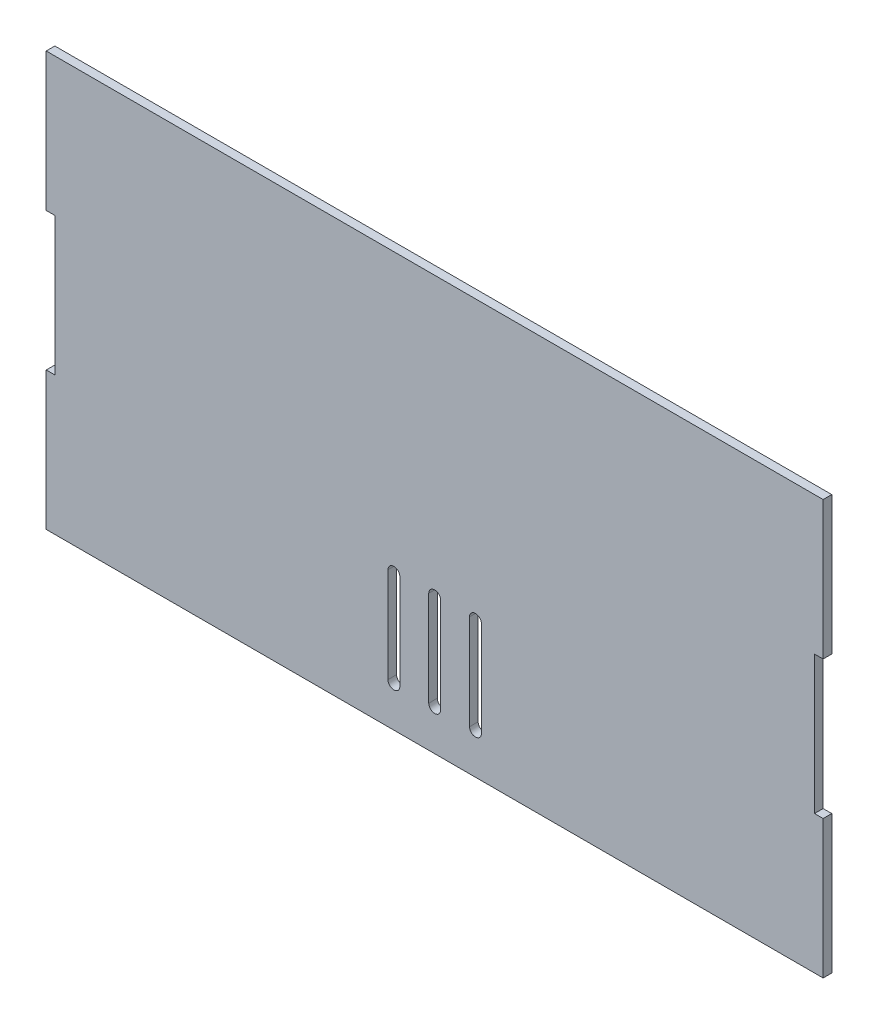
ISO-10303-21;
HEADER;
FILE_DESCRIPTION(('STEP AP214'),'2;1');
FILE_NAME('part.step','',(''),(''),'','','');
FILE_SCHEMA(('AUTOMOTIVE_DESIGN { 1 0 10303 214 1 1 1 1 }'));
ENDSEC;
DATA;
#1=APPLICATION_CONTEXT('core data for automotive mechanical design processes');
#2=APPLICATION_PROTOCOL_DEFINITION('international standard','automotive_design',2000,#1);
#3=PRODUCT_CONTEXT('',#1,'mechanical');
#4=PRODUCT('Part','Part','',(#3));
#5=PRODUCT_RELATED_PRODUCT_CATEGORY('part','',(#4));
#6=PRODUCT_DEFINITION_FORMATION('','',#4);
#7=PRODUCT_DEFINITION_CONTEXT('part definition',#1,'design');
#8=PRODUCT_DEFINITION('design','',#6,#7);
#9=PRODUCT_DEFINITION_SHAPE('','',#8);
#10=(LENGTH_UNIT() NAMED_UNIT(*) SI_UNIT(.MILLI.,.METRE.));
#11=(NAMED_UNIT(*) PLANE_ANGLE_UNIT() SI_UNIT($,.RADIAN.));
#12=(NAMED_UNIT(*) SI_UNIT($,.STERADIAN.) SOLID_ANGLE_UNIT());
#13=UNCERTAINTY_MEASURE_WITH_UNIT(LENGTH_MEASURE(1.E-05),#10,'distance_accuracy_value','');
#14=(GEOMETRIC_REPRESENTATION_CONTEXT(3) GLOBAL_UNCERTAINTY_ASSIGNED_CONTEXT((#13)) GLOBAL_UNIT_ASSIGNED_CONTEXT((#10,
#11,#12)) REPRESENTATION_CONTEXT('',''));
#15=CARTESIAN_POINT('',(0.,0.,0.));
#16=DIRECTION('',(0.,0.,1.));
#17=DIRECTION('',(1.,0.,0.));
#18=AXIS2_PLACEMENT_3D('',#15,#16,#17);
#19=CARTESIAN_POINT('',(142.875,152.4,1.5875));
#20=DIRECTION('',(-1.,0.,0.));
#21=DIRECTION('',(0.,0.,1.));
#22=AXIS2_PLACEMENT_3D('',#19,#20,#21);
#23=PLANE('',#22);
#24=DIRECTION('',(0.,0.,1.));
#25=VECTOR('',#24,1.);
#26=CARTESIAN_POINT('',(142.875,50.8,-1.5875));
#27=LINE('',#26,#25);
#28=CARTESIAN_POINT('',(142.875,50.8,-1.5875));
#29=VERTEX_POINT('',#28);
#30=CARTESIAN_POINT('',(142.875,50.8,1.5875));
#31=VERTEX_POINT('',#30);
#32=EDGE_CURVE('E310',#29,#31,#27,.T.);
#33=ORIENTED_EDGE('',*,*,#32,.T.);
#34=DIRECTION('',(0.,-1.,0.));
#35=VECTOR('',#34,1.);
#36=CARTESIAN_POINT('',(142.875,152.4,1.5875));
#37=LINE('',#36,#35);
#38=CARTESIAN_POINT('',(142.875,0.,1.5875));
#39=VERTEX_POINT('',#38);
#40=EDGE_CURVE('E355',#31,#39,#37,.T.);
#41=ORIENTED_EDGE('',*,*,#40,.T.);
#42=DIRECTION('',(0.,0.,-1.));
#43=VECTOR('',#42,1.);
#44=CARTESIAN_POINT('',(142.875,0.,1.5875));
#45=LINE('',#44,#43);
#46=CARTESIAN_POINT('',(142.875,0.,-1.5875));
#47=VERTEX_POINT('',#46);
#48=EDGE_CURVE('E339',#39,#47,#45,.T.);
#49=ORIENTED_EDGE('',*,*,#48,.T.);
#50=DIRECTION('',(0.,-1.,0.));
#51=VECTOR('',#50,1.);
#52=CARTESIAN_POINT('',(142.875,152.4,-1.5875));
#53=LINE('',#52,#51);
#54=EDGE_CURVE('E40',#29,#47,#53,.T.);
#55=ORIENTED_EDGE('',*,*,#54,.F.);
#56=EDGE_LOOP('',(#33,#41,#49,#55));
#57=FACE_BOUND('',#56,.T.);
#58=ADVANCED_FACE('F33',(#57),#23,.F.);
#59=DIRECTION('',(0.,0.,1.));
#60=VECTOR('',#59,1.);
#61=CARTESIAN_POINT('',(142.875,101.6,-1.5875));
#62=LINE('',#61,#60);
#63=CARTESIAN_POINT('',(142.875,101.6,-1.5875));
#64=VERTEX_POINT('',#63);
#65=CARTESIAN_POINT('',(142.875,101.6,1.5875));
#66=VERTEX_POINT('',#65);
#67=EDGE_CURVE('E302',#64,#66,#62,.T.);
#68=ORIENTED_EDGE('',*,*,#67,.F.);
#69=CARTESIAN_POINT('',(142.875,152.4,-1.5875));
#70=VERTEX_POINT('',#69);
#71=EDGE_CURVE('E11',#70,#64,#53,.T.);
#72=ORIENTED_EDGE('',*,*,#71,.F.);
#73=DIRECTION('',(0.,0.,-1.));
#74=VECTOR('',#73,1.);
#75=CARTESIAN_POINT('',(142.875,152.4,1.5875));
#76=LINE('',#75,#74);
#77=CARTESIAN_POINT('',(142.875,152.4,1.5875));
#78=VERTEX_POINT('',#77);
#79=EDGE_CURVE('E345',#78,#70,#76,.T.);
#80=ORIENTED_EDGE('',*,*,#79,.F.);
#81=EDGE_CURVE('E366',#78,#66,#37,.T.);
#82=ORIENTED_EDGE('',*,*,#81,.T.);
#83=EDGE_LOOP('',(#68,#72,#80,#82));
#84=FACE_BOUND('',#83,.T.);
#85=ADVANCED_FACE('F418',(#84),#23,.F.);
#86=CARTESIAN_POINT('',(-142.875,152.4,-1.5875));
#87=DIRECTION('',(0.,0.,1.));
#88=DIRECTION('',(1.,0.,0.));
#89=AXIS2_PLACEMENT_3D('',#86,#87,#88);
#90=PLANE('',#89);
#91=CARTESIAN_POINT('',(-15.,15.,-1.5875));
#92=DIRECTION('',(0.,0.,1.));
#93=DIRECTION('',(1.,0.,0.));
#94=AXIS2_PLACEMENT_3D('',#91,#92,#93);
#95=CIRCLE('',#94,2.1844);
#96=CARTESIAN_POINT('',(-17.1844,15.,-1.5875));
#97=VERTEX_POINT('',#96);
#98=CARTESIAN_POINT('',(-12.8156,15.,-1.5875));
#99=VERTEX_POINT('',#98);
#100=EDGE_CURVE('E203',#97,#99,#95,.T.);
#101=ORIENTED_EDGE('',*,*,#100,.T.);
#102=DIRECTION('',(0.,1.,0.));
#103=VECTOR('',#102,1.);
#104=CARTESIAN_POINT('',(-12.8156,0.,-1.5875));
#105=LINE('',#104,#103);
#106=CARTESIAN_POINT('',(-12.8156,50.,-1.5875));
#107=VERTEX_POINT('',#106);
#108=EDGE_CURVE('E198',#99,#107,#105,.T.);
#109=ORIENTED_EDGE('',*,*,#108,.T.);
#110=CARTESIAN_POINT('',(-15.,50.,-1.5875));
#111=DIRECTION('',(0.,0.,1.));
#112=DIRECTION('',(1.,0.,0.));
#113=AXIS2_PLACEMENT_3D('',#110,#111,#112);
#114=CIRCLE('',#113,2.1844);
#115=CARTESIAN_POINT('',(-17.1844,50.,-1.5875));
#116=VERTEX_POINT('',#115);
#117=EDGE_CURVE('E206',#107,#116,#114,.T.);
#118=ORIENTED_EDGE('',*,*,#117,.T.);
#119=DIRECTION('',(0.,1.,0.));
#120=VECTOR('',#119,1.);
#121=CARTESIAN_POINT('',(-17.1844,0.,-1.5875));
#122=LINE('',#121,#120);
#123=EDGE_CURVE('E210',#97,#116,#122,.T.);
#124=ORIENTED_EDGE('',*,*,#123,.F.);
#125=EDGE_LOOP('',(#101,#109,#118,#124));
#126=FACE_BOUND('',#125,.T.);
#127=CARTESIAN_POINT('',(0.,15.,-1.5875));
#128=DIRECTION('',(0.,0.,1.));
#129=DIRECTION('',(1.,0.,0.));
#130=AXIS2_PLACEMENT_3D('',#127,#128,#129);
#131=CIRCLE('',#130,2.1844);
#132=CARTESIAN_POINT('',(-2.1844,15.,-1.5875));
#133=VERTEX_POINT('',#132);
#134=CARTESIAN_POINT('',(2.1844,15.,-1.5875));
#135=VERTEX_POINT('',#134);
#136=EDGE_CURVE('E244',#133,#135,#131,.T.);
#137=ORIENTED_EDGE('',*,*,#136,.T.);
#138=DIRECTION('',(0.,1.,0.));
#139=VECTOR('',#138,1.);
#140=CARTESIAN_POINT('',(2.1844,0.,-1.5875));
#141=LINE('',#140,#139);
#142=CARTESIAN_POINT('',(2.1844,50.,-1.5875));
#143=VERTEX_POINT('',#142);
#144=EDGE_CURVE('E235',#135,#143,#141,.T.);
#145=ORIENTED_EDGE('',*,*,#144,.T.);
#146=CARTESIAN_POINT('',(0.,50.,-1.5875));
#147=DIRECTION('',(0.,0.,1.));
#148=DIRECTION('',(1.,0.,0.));
#149=AXIS2_PLACEMENT_3D('',#146,#147,#148);
#150=CIRCLE('',#149,2.1844);
#151=CARTESIAN_POINT('',(-2.1844,50.,-1.5875));
#152=VERTEX_POINT('',#151);
#153=EDGE_CURVE('E238',#143,#152,#150,.T.);
#154=ORIENTED_EDGE('',*,*,#153,.T.);
#155=DIRECTION('',(0.,1.,0.));
#156=VECTOR('',#155,1.);
#157=CARTESIAN_POINT('',(-2.1844,0.,-1.5875));
#158=LINE('',#157,#156);
#159=EDGE_CURVE('E242',#133,#152,#158,.T.);
#160=ORIENTED_EDGE('',*,*,#159,.F.);
#161=EDGE_LOOP('',(#137,#145,#154,#160));
#162=FACE_BOUND('',#161,.T.);
#163=CARTESIAN_POINT('',(15.,15.,-1.5875));
#164=DIRECTION('',(0.,0.,1.));
#165=DIRECTION('',(1.,0.,0.));
#166=AXIS2_PLACEMENT_3D('',#163,#164,#165);
#167=CIRCLE('',#166,2.1844);
#168=CARTESIAN_POINT('',(12.8156,15.,-1.5875));
#169=VERTEX_POINT('',#168);
#170=CARTESIAN_POINT('',(17.1844,15.,-1.5875));
#171=VERTEX_POINT('',#170);
#172=EDGE_CURVE('E274',#169,#171,#167,.T.);
#173=ORIENTED_EDGE('',*,*,#172,.T.);
#174=DIRECTION('',(0.,1.,0.));
#175=VECTOR('',#174,1.);
#176=CARTESIAN_POINT('',(17.1844,0.,-1.5875));
#177=LINE('',#176,#175);
#178=CARTESIAN_POINT('',(17.1844,50.,-1.5875));
#179=VERTEX_POINT('',#178);
#180=EDGE_CURVE('E264',#171,#179,#177,.T.);
#181=ORIENTED_EDGE('',*,*,#180,.T.);
#182=CARTESIAN_POINT('',(15.,50.,-1.5875));
#183=DIRECTION('',(0.,0.,1.));
#184=DIRECTION('',(1.,0.,0.));
#185=AXIS2_PLACEMENT_3D('',#182,#183,#184);
#186=CIRCLE('',#185,2.1844);
#187=CARTESIAN_POINT('',(12.8156,50.,-1.5875));
#188=VERTEX_POINT('',#187);
#189=EDGE_CURVE('E267',#179,#188,#186,.T.);
#190=ORIENTED_EDGE('',*,*,#189,.T.);
#191=DIRECTION('',(0.,1.,0.));
#192=VECTOR('',#191,1.);
#193=CARTESIAN_POINT('',(12.8156,0.,-1.5875));
#194=LINE('',#193,#192);
#195=EDGE_CURVE('E271',#169,#188,#194,.T.);
#196=ORIENTED_EDGE('',*,*,#195,.F.);
#197=EDGE_LOOP('',(#173,#181,#190,#196));
#198=FACE_BOUND('',#197,.T.);
#199=DIRECTION('',(-1.,0.,0.));
#200=VECTOR('',#199,1.);
#201=CARTESIAN_POINT('',(142.875,50.8,-1.5875));
#202=LINE('',#201,#200);
#203=CARTESIAN_POINT('',(139.7,50.8,-1.5875));
#204=VERTEX_POINT('',#203);
#205=EDGE_CURVE('E300',#29,#204,#202,.T.);
#206=ORIENTED_EDGE('',*,*,#205,.F.);
#207=ORIENTED_EDGE('',*,*,#54,.T.);
#208=DIRECTION('',(-1.,0.,0.));
#209=VECTOR('',#208,1.);
#210=CARTESIAN_POINT('',(-142.875,0.,-1.5875));
#211=LINE('',#210,#209);
#212=CARTESIAN_POINT('',(-142.875,0.,-1.5875));
#213=VERTEX_POINT('',#212);
#214=EDGE_CURVE('E358',#47,#213,#211,.T.);
#215=ORIENTED_EDGE('',*,*,#214,.T.);
#216=DIRECTION('',(0.,-1.,0.));
#217=VECTOR('',#216,1.);
#218=CARTESIAN_POINT('',(-142.875,152.4,-1.5875));
#219=LINE('',#218,#217);
#220=CARTESIAN_POINT('',(-142.875,50.8,-1.5875));
#221=VERTEX_POINT('',#220);
#222=EDGE_CURVE('E372',#221,#213,#219,.T.);
#223=ORIENTED_EDGE('',*,*,#222,.F.);
#224=DIRECTION('',(1.,0.,0.));
#225=VECTOR('',#224,1.);
#226=CARTESIAN_POINT('',(-142.875,50.8,-1.5875));
#227=LINE('',#226,#225);
#228=CARTESIAN_POINT('',(-139.7,50.8,-1.5875));
#229=VERTEX_POINT('',#228);
#230=EDGE_CURVE('E319',#221,#229,#227,.T.);
#231=ORIENTED_EDGE('',*,*,#230,.T.);
#232=DIRECTION('',(0.,1.,0.));
#233=VECTOR('',#232,1.);
#234=CARTESIAN_POINT('',(-139.7,50.8,-1.5875));
#235=LINE('',#234,#233);
#236=CARTESIAN_POINT('',(-139.7,101.6,-1.5875));
#237=VERTEX_POINT('',#236);
#238=EDGE_CURVE('E322',#229,#237,#235,.T.);
#239=ORIENTED_EDGE('',*,*,#238,.T.);
#240=DIRECTION('',(-1.,0.,0.));
#241=VECTOR('',#240,1.);
#242=CARTESIAN_POINT('',(-142.875,101.6,-1.5875));
#243=LINE('',#242,#241);
#244=CARTESIAN_POINT('',(-142.875,101.6,-1.5875));
#245=VERTEX_POINT('',#244);
#246=EDGE_CURVE('E326',#237,#245,#243,.T.);
#247=ORIENTED_EDGE('',*,*,#246,.T.);
#248=CARTESIAN_POINT('',(-142.875,152.4,-1.5875));
#249=VERTEX_POINT('',#248);
#250=EDGE_CURVE('E373',#249,#245,#219,.T.);
#251=ORIENTED_EDGE('',*,*,#250,.F.);
#252=DIRECTION('',(-1.,0.,0.));
#253=VECTOR('',#252,1.);
#254=CARTESIAN_POINT('',(-142.875,152.4,-1.5875));
#255=LINE('',#254,#253);
#256=EDGE_CURVE('E348',#70,#249,#255,.T.);
#257=ORIENTED_EDGE('',*,*,#256,.F.);
#258=ORIENTED_EDGE('',*,*,#71,.T.);
#259=DIRECTION('',(1.,0.,0.));
#260=VECTOR('',#259,1.);
#261=CARTESIAN_POINT('',(142.875,101.6,-1.5875));
#262=LINE('',#261,#260);
#263=CARTESIAN_POINT('',(139.7,101.6,-1.5875));
#264=VERTEX_POINT('',#263);
#265=EDGE_CURVE('E295',#264,#64,#262,.T.);
#266=ORIENTED_EDGE('',*,*,#265,.F.);
#267=DIRECTION('',(0.,1.,0.));
#268=VECTOR('',#267,1.);
#269=CARTESIAN_POINT('',(139.7,50.8,-1.5875));
#270=LINE('',#269,#268);
#271=EDGE_CURVE('E297',#204,#264,#270,.T.);
#272=ORIENTED_EDGE('',*,*,#271,.F.);
#273=EDGE_LOOP('',(#206,#207,#215,#223,#231,#239,#247,#251,#257,#258,#266,#272));
#274=FACE_BOUND('',#273,.T.);
#275=ADVANCED_FACE('F212',(#126,#162,#198,#274),#90,.F.);
#276=CARTESIAN_POINT('',(-142.875,152.4,1.5875));
#277=DIRECTION('',(0.,0.,-1.));
#278=DIRECTION('',(-1.,0.,0.));
#279=AXIS2_PLACEMENT_3D('',#276,#277,#278);
#280=PLANE('',#279);
#281=CARTESIAN_POINT('',(-15.,50.,1.5875));
#282=DIRECTION('',(0.,0.,1.));
#283=DIRECTION('',(1.,0.,0.));
#284=AXIS2_PLACEMENT_3D('',#281,#282,#283);
#285=CIRCLE('',#284,2.1844);
#286=CARTESIAN_POINT('',(-12.8156,50.,1.5875));
#287=VERTEX_POINT('',#286);
#288=CARTESIAN_POINT('',(-17.1844,50.,1.5875));
#289=VERTEX_POINT('',#288);
#290=EDGE_CURVE('E224',#287,#289,#285,.T.);
#291=ORIENTED_EDGE('',*,*,#290,.F.);
#292=DIRECTION('',(0.,1.,0.));
#293=VECTOR('',#292,1.);
#294=CARTESIAN_POINT('',(-12.8156,0.,1.5875));
#295=LINE('',#294,#293);
#296=CARTESIAN_POINT('',(-12.8156,15.,1.5875));
#297=VERTEX_POINT('',#296);
#298=EDGE_CURVE('E201',#297,#287,#295,.T.);
#299=ORIENTED_EDGE('',*,*,#298,.F.);
#300=CARTESIAN_POINT('',(-15.,15.,1.5875));
#301=DIRECTION('',(0.,0.,1.));
#302=DIRECTION('',(1.,0.,0.));
#303=AXIS2_PLACEMENT_3D('',#300,#301,#302);
#304=CIRCLE('',#303,2.1844);
#305=CARTESIAN_POINT('',(-17.1844,15.,1.5875));
#306=VERTEX_POINT('',#305);
#307=EDGE_CURVE('E215',#306,#297,#304,.T.);
#308=ORIENTED_EDGE('',*,*,#307,.F.);
#309=DIRECTION('',(0.,1.,0.));
#310=VECTOR('',#309,1.);
#311=CARTESIAN_POINT('',(-17.1844,0.,1.5875));
#312=LINE('',#311,#310);
#313=EDGE_CURVE('E218',#306,#289,#312,.T.);
#314=ORIENTED_EDGE('',*,*,#313,.T.);
#315=EDGE_LOOP('',(#291,#299,#308,#314));
#316=FACE_BOUND('',#315,.T.);
#317=CARTESIAN_POINT('',(0.,50.,1.5875));
#318=DIRECTION('',(0.,0.,1.));
#319=DIRECTION('',(1.,0.,0.));
#320=AXIS2_PLACEMENT_3D('',#317,#318,#319);
#321=CIRCLE('',#320,2.1844);
#322=CARTESIAN_POINT('',(2.1844,50.,1.5875));
#323=VERTEX_POINT('',#322);
#324=CARTESIAN_POINT('',(-2.1844,50.,1.5875));
#325=VERTEX_POINT('',#324);
#326=EDGE_CURVE('E250',#323,#325,#321,.T.);
#327=ORIENTED_EDGE('',*,*,#326,.F.);
#328=DIRECTION('',(0.,1.,0.));
#329=VECTOR('',#328,1.);
#330=CARTESIAN_POINT('',(2.1844,0.,1.5875));
#331=LINE('',#330,#329);
#332=CARTESIAN_POINT('',(2.1844,15.,1.5875));
#333=VERTEX_POINT('',#332);
#334=EDGE_CURVE('E248',#333,#323,#331,.T.);
#335=ORIENTED_EDGE('',*,*,#334,.F.);
#336=CARTESIAN_POINT('',(0.,15.,1.5875));
#337=DIRECTION('',(0.,0.,1.));
#338=DIRECTION('',(1.,0.,0.));
#339=AXIS2_PLACEMENT_3D('',#336,#337,#338);
#340=CIRCLE('',#339,2.1844);
#341=CARTESIAN_POINT('',(-2.1844,15.,1.5875));
#342=VERTEX_POINT('',#341);
#343=EDGE_CURVE('E239',#342,#333,#340,.T.);
#344=ORIENTED_EDGE('',*,*,#343,.F.);
#345=DIRECTION('',(0.,1.,0.));
#346=VECTOR('',#345,1.);
#347=CARTESIAN_POINT('',(-2.1844,0.,1.5875));
#348=LINE('',#347,#346);
#349=EDGE_CURVE('E253',#342,#325,#348,.T.);
#350=ORIENTED_EDGE('',*,*,#349,.T.);
#351=EDGE_LOOP('',(#327,#335,#344,#350));
#352=FACE_BOUND('',#351,.T.);
#353=CARTESIAN_POINT('',(15.,50.,1.5875));
#354=DIRECTION('',(0.,0.,1.));
#355=DIRECTION('',(1.,0.,0.));
#356=AXIS2_PLACEMENT_3D('',#353,#354,#355);
#357=CIRCLE('',#356,2.1844);
#358=CARTESIAN_POINT('',(17.1844,50.,1.5875));
#359=VERTEX_POINT('',#358);
#360=CARTESIAN_POINT('',(12.8156,50.,1.5875));
#361=VERTEX_POINT('',#360);
#362=EDGE_CURVE('E280',#359,#361,#357,.T.);
#363=ORIENTED_EDGE('',*,*,#362,.F.);
#364=DIRECTION('',(0.,1.,0.));
#365=VECTOR('',#364,1.);
#366=CARTESIAN_POINT('',(17.1844,0.,1.5875));
#367=LINE('',#366,#365);
#368=CARTESIAN_POINT('',(17.1844,15.,1.5875));
#369=VERTEX_POINT('',#368);
#370=EDGE_CURVE('E278',#369,#359,#367,.T.);
#371=ORIENTED_EDGE('',*,*,#370,.F.);
#372=CARTESIAN_POINT('',(15.,15.,1.5875));
#373=DIRECTION('',(0.,0.,1.));
#374=DIRECTION('',(1.,0.,0.));
#375=AXIS2_PLACEMENT_3D('',#372,#373,#374);
#376=CIRCLE('',#375,2.1844);
#377=CARTESIAN_POINT('',(12.8156,15.,1.5875));
#378=VERTEX_POINT('',#377);
#379=EDGE_CURVE('E268',#378,#369,#376,.T.);
#380=ORIENTED_EDGE('',*,*,#379,.F.);
#381=DIRECTION('',(0.,1.,0.));
#382=VECTOR('',#381,1.);
#383=CARTESIAN_POINT('',(12.8156,0.,1.5875));
#384=LINE('',#383,#382);
#385=EDGE_CURVE('E283',#378,#361,#384,.T.);
#386=ORIENTED_EDGE('',*,*,#385,.T.);
#387=EDGE_LOOP('',(#363,#371,#380,#386));
#388=FACE_BOUND('',#387,.T.);
#389=DIRECTION('',(-1.,0.,0.));
#390=VECTOR('',#389,1.);
#391=CARTESIAN_POINT('',(142.875,50.8,1.5875));
#392=LINE('',#391,#390);
#393=CARTESIAN_POINT('',(139.7,50.8,1.5875));
#394=VERTEX_POINT('',#393);
#395=EDGE_CURVE('E298',#31,#394,#392,.T.);
#396=ORIENTED_EDGE('',*,*,#395,.T.);
#397=DIRECTION('',(0.,1.,0.));
#398=VECTOR('',#397,1.);
#399=CARTESIAN_POINT('',(139.7,50.8,1.5875));
#400=LINE('',#399,#398);
#401=CARTESIAN_POINT('',(139.7,101.6,1.5875));
#402=VERTEX_POINT('',#401);
#403=EDGE_CURVE('E305',#394,#402,#400,.T.);
#404=ORIENTED_EDGE('',*,*,#403,.T.);
#405=DIRECTION('',(1.,0.,0.));
#406=VECTOR('',#405,1.);
#407=CARTESIAN_POINT('',(142.875,101.6,1.5875));
#408=LINE('',#407,#406);
#409=EDGE_CURVE('E231',#402,#66,#408,.T.);
#410=ORIENTED_EDGE('',*,*,#409,.T.);
#411=ORIENTED_EDGE('',*,*,#81,.F.);
#412=DIRECTION('',(1.,0.,0.));
#413=VECTOR('',#412,1.);
#414=CARTESIAN_POINT('',(-142.875,152.4,1.5875));
#415=LINE('',#414,#413);
#416=CARTESIAN_POINT('',(-142.875,152.4,1.5875));
#417=VERTEX_POINT('',#416);
#418=EDGE_CURVE('E353',#417,#78,#415,.T.);
#419=ORIENTED_EDGE('',*,*,#418,.F.);
#420=DIRECTION('',(0.,-1.,0.));
#421=VECTOR('',#420,1.);
#422=CARTESIAN_POINT('',(-142.875,152.4,1.5875));
#423=LINE('',#422,#421);
#424=CARTESIAN_POINT('',(-142.875,101.6,1.5875));
#425=VERTEX_POINT('',#424);
#426=EDGE_CURVE('E370',#417,#425,#423,.T.);
#427=ORIENTED_EDGE('',*,*,#426,.T.);
#428=DIRECTION('',(-1.,0.,0.));
#429=VECTOR('',#428,1.);
#430=CARTESIAN_POINT('',(-142.875,101.6,1.5875));
#431=LINE('',#430,#429);
#432=CARTESIAN_POINT('',(-139.7,101.6,1.5875));
#433=VERTEX_POINT('',#432);
#434=EDGE_CURVE('E323',#433,#425,#431,.T.);
#435=ORIENTED_EDGE('',*,*,#434,.F.);
#436=DIRECTION('',(0.,1.,0.));
#437=VECTOR('',#436,1.);
#438=CARTESIAN_POINT('',(-139.7,50.8,1.5875));
#439=LINE('',#438,#437);
#440=CARTESIAN_POINT('',(-139.7,50.8,1.5875));
#441=VERTEX_POINT('',#440);
#442=EDGE_CURVE('E332',#441,#433,#439,.T.);
#443=ORIENTED_EDGE('',*,*,#442,.F.);
#444=DIRECTION('',(1.,0.,0.));
#445=VECTOR('',#444,1.);
#446=CARTESIAN_POINT('',(-142.875,50.8,1.5875));
#447=LINE('',#446,#445);
#448=CARTESIAN_POINT('',(-142.875,50.8,1.5875));
#449=VERTEX_POINT('',#448);
#450=EDGE_CURVE('E313',#449,#441,#447,.T.);
#451=ORIENTED_EDGE('',*,*,#450,.F.);
#452=CARTESIAN_POINT('',(-142.875,0.,1.5875));
#453=VERTEX_POINT('',#452);
#454=EDGE_CURVE('E369',#449,#453,#423,.T.);
#455=ORIENTED_EDGE('',*,*,#454,.T.);
#456=DIRECTION('',(1.,0.,0.));
#457=VECTOR('',#456,1.);
#458=CARTESIAN_POINT('',(-142.875,0.,1.5875));
#459=LINE('',#458,#457);
#460=EDGE_CURVE('E349',#453,#39,#459,.T.);
#461=ORIENTED_EDGE('',*,*,#460,.T.);
#462=ORIENTED_EDGE('',*,*,#40,.F.);
#463=EDGE_LOOP('',(#396,#404,#410,#411,#419,#427,#435,#443,#451,#455,#461,#462));
#464=FACE_BOUND('',#463,.T.);
#465=ADVANCED_FACE('F394',(#316,#352,#388,#464),#280,.F.);
#466=CARTESIAN_POINT('',(-142.875,152.4,1.5875));
#467=DIRECTION('',(1.,0.,0.));
#468=DIRECTION('',(0.,0.,-1.));
#469=AXIS2_PLACEMENT_3D('',#466,#467,#468);
#470=PLANE('',#469);
#471=ORIENTED_EDGE('',*,*,#250,.T.);
#472=DIRECTION('',(0.,0.,1.));
#473=VECTOR('',#472,1.);
#474=CARTESIAN_POINT('',(-142.875,101.6,-1.5875));
#475=LINE('',#474,#473);
#476=EDGE_CURVE('E336',#245,#425,#475,.T.);
#477=ORIENTED_EDGE('',*,*,#476,.T.);
#478=ORIENTED_EDGE('',*,*,#426,.F.);
#479=DIRECTION('',(0.,0.,1.));
#480=VECTOR('',#479,1.);
#481=CARTESIAN_POINT('',(-142.875,152.4,1.5875));
#482=LINE('',#481,#480);
#483=EDGE_CURVE('E351',#249,#417,#482,.T.);
#484=ORIENTED_EDGE('',*,*,#483,.F.);
#485=EDGE_LOOP('',(#471,#477,#478,#484));
#486=FACE_BOUND('',#485,.T.);
#487=ADVANCED_FACE('F407',(#486),#470,.F.);
#488=ORIENTED_EDGE('',*,*,#454,.F.);
#489=DIRECTION('',(0.,0.,1.));
#490=VECTOR('',#489,1.);
#491=CARTESIAN_POINT('',(-142.875,50.8,-1.5875));
#492=LINE('',#491,#490);
#493=EDGE_CURVE('E329',#221,#449,#492,.T.);
#494=ORIENTED_EDGE('',*,*,#493,.F.);
#495=ORIENTED_EDGE('',*,*,#222,.T.);
#496=DIRECTION('',(0.,0.,1.));
#497=VECTOR('',#496,1.);
#498=CARTESIAN_POINT('',(-142.875,0.,1.5875));
#499=LINE('',#498,#497);
#500=EDGE_CURVE('E361',#213,#453,#499,.T.);
#501=ORIENTED_EDGE('',*,*,#500,.T.);
#502=EDGE_LOOP('',(#488,#494,#495,#501));
#503=FACE_BOUND('',#502,.T.);
#504=ADVANCED_FACE('F382',(#503),#470,.F.);
#505=CARTESIAN_POINT('',(0.,152.4,0.));
#506=DIRECTION('',(0.,-1.,0.));
#507=DIRECTION('',(0.,0.,-1.));
#508=AXIS2_PLACEMENT_3D('',#505,#506,#507);
#509=PLANE('',#508);
#510=ORIENTED_EDGE('',*,*,#79,.T.);
#511=ORIENTED_EDGE('',*,*,#256,.T.);
#512=ORIENTED_EDGE('',*,*,#483,.T.);
#513=ORIENTED_EDGE('',*,*,#418,.T.);
#514=EDGE_LOOP('',(#510,#511,#512,#513));
#515=FACE_BOUND('',#514,.T.);
#516=ADVANCED_FACE('F412',(#515),#509,.F.);
#517=CARTESIAN_POINT('',(0.,0.,0.));
#518=DIRECTION('',(0.,-1.,0.));
#519=DIRECTION('',(0.,0.,-1.));
#520=AXIS2_PLACEMENT_3D('',#517,#518,#519);
#521=PLANE('',#520);
#522=ORIENTED_EDGE('',*,*,#48,.F.);
#523=ORIENTED_EDGE('',*,*,#460,.F.);
#524=ORIENTED_EDGE('',*,*,#500,.F.);
#525=ORIENTED_EDGE('',*,*,#214,.F.);
#526=EDGE_LOOP('',(#522,#523,#524,#525));
#527=FACE_BOUND('',#526,.T.);
#528=ADVANCED_FACE('F391',(#527),#521,.T.);
#529=CARTESIAN_POINT('',(-142.875,101.6,-1.5875));
#530=DIRECTION('',(0.,1.,0.));
#531=DIRECTION('',(-1.,0.,0.));
#532=AXIS2_PLACEMENT_3D('',#529,#530,#531);
#533=PLANE('',#532);
#534=ORIENTED_EDGE('',*,*,#434,.T.);
#535=ORIENTED_EDGE('',*,*,#476,.F.);
#536=ORIENTED_EDGE('',*,*,#246,.F.);
#537=DIRECTION('',(0.,0.,1.));
#538=VECTOR('',#537,1.);
#539=CARTESIAN_POINT('',(-139.7,101.6,-1.5875));
#540=LINE('',#539,#538);
#541=EDGE_CURVE('E340',#237,#433,#540,.T.);
#542=ORIENTED_EDGE('',*,*,#541,.T.);
#543=EDGE_LOOP('',(#534,#535,#536,#542));
#544=FACE_BOUND('',#543,.T.);
#545=ADVANCED_FACE('F405',(#544),#533,.F.);
#546=CARTESIAN_POINT('',(-139.7,50.8,-1.5875));
#547=DIRECTION('',(1.,0.,0.));
#548=DIRECTION('',(0.,0.,-1.));
#549=AXIS2_PLACEMENT_3D('',#546,#547,#548);
#550=PLANE('',#549);
#551=ORIENTED_EDGE('',*,*,#442,.T.);
#552=ORIENTED_EDGE('',*,*,#541,.F.);
#553=ORIENTED_EDGE('',*,*,#238,.F.);
#554=DIRECTION('',(0.,0.,1.));
#555=VECTOR('',#554,1.);
#556=CARTESIAN_POINT('',(-139.7,50.8,-1.5875));
#557=LINE('',#556,#555);
#558=EDGE_CURVE('E342',#229,#441,#557,.T.);
#559=ORIENTED_EDGE('',*,*,#558,.T.);
#560=EDGE_LOOP('',(#551,#552,#553,#559));
#561=FACE_BOUND('',#560,.T.);
#562=ADVANCED_FACE('F403',(#561),#550,.F.);
#563=CARTESIAN_POINT('',(-142.875,50.8,-1.5875));
#564=DIRECTION('',(0.,-1.,0.));
#565=DIRECTION('',(1.,0.,0.));
#566=AXIS2_PLACEMENT_3D('',#563,#564,#565);
#567=PLANE('',#566);
#568=ORIENTED_EDGE('',*,*,#450,.T.);
#569=ORIENTED_EDGE('',*,*,#558,.F.);
#570=ORIENTED_EDGE('',*,*,#230,.F.);
#571=ORIENTED_EDGE('',*,*,#493,.T.);
#572=EDGE_LOOP('',(#568,#569,#570,#571));
#573=FACE_BOUND('',#572,.T.);
#574=ADVANCED_FACE('F399',(#573),#567,.F.);
#575=CARTESIAN_POINT('',(142.875,50.8,-1.5875));
#576=DIRECTION('',(0.,1.,0.));
#577=DIRECTION('',(-1.,0.,0.));
#578=AXIS2_PLACEMENT_3D('',#575,#576,#577);
#579=PLANE('',#578);
#580=ORIENTED_EDGE('',*,*,#395,.F.);
#581=ORIENTED_EDGE('',*,*,#32,.F.);
#582=ORIENTED_EDGE('',*,*,#205,.T.);
#583=DIRECTION('',(0.,0.,1.));
#584=VECTOR('',#583,1.);
#585=CARTESIAN_POINT('',(139.7,50.8,-1.5875));
#586=LINE('',#585,#584);
#587=EDGE_CURVE('E314',#204,#394,#586,.T.);
#588=ORIENTED_EDGE('',*,*,#587,.T.);
#589=EDGE_LOOP('',(#580,#581,#582,#588));
#590=FACE_BOUND('',#589,.T.);
#591=ADVANCED_FACE('F429',(#590),#579,.T.);
#592=CARTESIAN_POINT('',(139.7,50.8,-1.5875));
#593=DIRECTION('',(1.,0.,0.));
#594=DIRECTION('',(0.,0.,-1.));
#595=AXIS2_PLACEMENT_3D('',#592,#593,#594);
#596=PLANE('',#595);
#597=ORIENTED_EDGE('',*,*,#403,.F.);
#598=ORIENTED_EDGE('',*,*,#587,.F.);
#599=ORIENTED_EDGE('',*,*,#271,.T.);
#600=DIRECTION('',(0.,0.,1.));
#601=VECTOR('',#600,1.);
#602=CARTESIAN_POINT('',(139.7,101.6,-1.5875));
#603=LINE('',#602,#601);
#604=EDGE_CURVE('E316',#264,#402,#603,.T.);
#605=ORIENTED_EDGE('',*,*,#604,.T.);
#606=EDGE_LOOP('',(#597,#598,#599,#605));
#607=FACE_BOUND('',#606,.T.);
#608=ADVANCED_FACE('F426',(#607),#596,.T.);
#609=CARTESIAN_POINT('',(142.875,101.6,-1.5875));
#610=DIRECTION('',(0.,-1.,0.));
#611=DIRECTION('',(1.,0.,0.));
#612=AXIS2_PLACEMENT_3D('',#609,#610,#611);
#613=PLANE('',#612);
#614=ORIENTED_EDGE('',*,*,#409,.F.);
#615=ORIENTED_EDGE('',*,*,#604,.F.);
#616=ORIENTED_EDGE('',*,*,#265,.T.);
#617=ORIENTED_EDGE('',*,*,#67,.T.);
#618=EDGE_LOOP('',(#614,#615,#616,#617));
#619=FACE_BOUND('',#618,.T.);
#620=ADVANCED_FACE('F421',(#619),#613,.T.);
#621=CARTESIAN_POINT('',(17.1844,0.,-1.5875));
#622=DIRECTION('',(1.,0.,0.));
#623=DIRECTION('',(0.,0.,-1.));
#624=AXIS2_PLACEMENT_3D('',#621,#622,#623);
#625=PLANE('',#624);
#626=ORIENTED_EDGE('',*,*,#370,.T.);
#627=DIRECTION('',(0.,0.,1.));
#628=VECTOR('',#627,1.);
#629=CARTESIAN_POINT('',(17.1844,50.,-1.5875));
#630=LINE('',#629,#628);
#631=EDGE_CURVE('E277',#179,#359,#630,.T.);
#632=ORIENTED_EDGE('',*,*,#631,.F.);
#633=ORIENTED_EDGE('',*,*,#180,.F.);
#634=DIRECTION('',(0.,0.,1.));
#635=VECTOR('',#634,1.);
#636=CARTESIAN_POINT('',(17.1844,15.,-1.5875));
#637=LINE('',#636,#635);
#638=EDGE_CURVE('E251',#171,#369,#637,.T.);
#639=ORIENTED_EDGE('',*,*,#638,.T.);
#640=EDGE_LOOP('',(#626,#632,#633,#639));
#641=FACE_BOUND('',#640,.T.);
#642=ADVANCED_FACE('F463',(#641),#625,.F.);
#643=CARTESIAN_POINT('',(15.,15.,-1.5875));
#644=DIRECTION('',(0.,0.,1.));
#645=DIRECTION('',(1.,0.,0.));
#646=AXIS2_PLACEMENT_3D('',#643,#644,#645);
#647=CYLINDRICAL_SURFACE('',#646,2.1844);
#648=ORIENTED_EDGE('',*,*,#379,.T.);
#649=ORIENTED_EDGE('',*,*,#638,.F.);
#650=ORIENTED_EDGE('',*,*,#172,.F.);
#651=DIRECTION('',(0.,0.,1.));
#652=VECTOR('',#651,1.);
#653=CARTESIAN_POINT('',(12.8156,15.,-1.5875));
#654=LINE('',#653,#652);
#655=EDGE_CURVE('E289',#169,#378,#654,.T.);
#656=ORIENTED_EDGE('',*,*,#655,.T.);
#657=EDGE_LOOP('',(#648,#649,#650,#656));
#658=FACE_BOUND('',#657,.T.);
#659=ADVANCED_FACE('F467',(#658),#647,.F.);
#660=CARTESIAN_POINT('',(12.8156,0.,-1.5875));
#661=DIRECTION('',(1.,0.,0.));
#662=DIRECTION('',(0.,0.,-1.));
#663=AXIS2_PLACEMENT_3D('',#660,#661,#662);
#664=PLANE('',#663);
#665=ORIENTED_EDGE('',*,*,#385,.F.);
#666=ORIENTED_EDGE('',*,*,#655,.F.);
#667=ORIENTED_EDGE('',*,*,#195,.T.);
#668=DIRECTION('',(0.,0.,1.));
#669=VECTOR('',#668,1.);
#670=CARTESIAN_POINT('',(12.8156,50.,-1.5875));
#671=LINE('',#670,#669);
#672=EDGE_CURVE('E291',#188,#361,#671,.T.);
#673=ORIENTED_EDGE('',*,*,#672,.T.);
#674=EDGE_LOOP('',(#665,#666,#667,#673));
#675=FACE_BOUND('',#674,.T.);
#676=ADVANCED_FACE('F472',(#675),#664,.T.);
#677=CARTESIAN_POINT('',(15.,50.,-1.5875));
#678=DIRECTION('',(0.,0.,1.));
#679=DIRECTION('',(1.,0.,0.));
#680=AXIS2_PLACEMENT_3D('',#677,#678,#679);
#681=CYLINDRICAL_SURFACE('',#680,2.1844);
#682=ORIENTED_EDGE('',*,*,#362,.T.);
#683=ORIENTED_EDGE('',*,*,#672,.F.);
#684=ORIENTED_EDGE('',*,*,#189,.F.);
#685=ORIENTED_EDGE('',*,*,#631,.T.);
#686=EDGE_LOOP('',(#682,#683,#684,#685));
#687=FACE_BOUND('',#686,.T.);
#688=ADVANCED_FACE('F476',(#687),#681,.F.);
#689=CARTESIAN_POINT('',(2.1844,0.,-1.5875));
#690=DIRECTION('',(1.,0.,0.));
#691=DIRECTION('',(0.,1.,0.));
#692=AXIS2_PLACEMENT_3D('',#689,#690,#691);
#693=PLANE('',#692);
#694=ORIENTED_EDGE('',*,*,#334,.T.);
#695=DIRECTION('',(0.,0.,1.));
#696=VECTOR('',#695,1.);
#697=CARTESIAN_POINT('',(2.1844,50.,-1.5875));
#698=LINE('',#697,#696);
#699=EDGE_CURVE('E247',#143,#323,#698,.T.);
#700=ORIENTED_EDGE('',*,*,#699,.F.);
#701=ORIENTED_EDGE('',*,*,#144,.F.);
#702=DIRECTION('',(0.,0.,1.));
#703=VECTOR('',#702,1.);
#704=CARTESIAN_POINT('',(2.1844,15.,-1.5875));
#705=LINE('',#704,#703);
#706=EDGE_CURVE('E225',#135,#333,#705,.T.);
#707=ORIENTED_EDGE('',*,*,#706,.T.);
#708=EDGE_LOOP('',(#694,#700,#701,#707));
#709=FACE_BOUND('',#708,.T.);
#710=ADVANCED_FACE('F479',(#709),#693,.F.);
#711=CARTESIAN_POINT('',(0.,15.,-1.5875));
#712=DIRECTION('',(0.,0.,1.));
#713=DIRECTION('',(1.,0.,0.));
#714=AXIS2_PLACEMENT_3D('',#711,#712,#713);
#715=CYLINDRICAL_SURFACE('',#714,2.1844);
#716=ORIENTED_EDGE('',*,*,#343,.T.);
#717=ORIENTED_EDGE('',*,*,#706,.F.);
#718=ORIENTED_EDGE('',*,*,#136,.F.);
#719=DIRECTION('',(0.,0.,1.));
#720=VECTOR('',#719,1.);
#721=CARTESIAN_POINT('',(-2.1844,15.,-1.5875));
#722=LINE('',#721,#720);
#723=EDGE_CURVE('E259',#133,#342,#722,.T.);
#724=ORIENTED_EDGE('',*,*,#723,.T.);
#725=EDGE_LOOP('',(#716,#717,#718,#724));
#726=FACE_BOUND('',#725,.T.);
#727=ADVANCED_FACE('F486',(#726),#715,.F.);
#728=CARTESIAN_POINT('',(-2.1844,0.,-1.5875));
#729=DIRECTION('',(1.,0.,0.));
#730=DIRECTION('',(0.,1.,0.));
#731=AXIS2_PLACEMENT_3D('',#728,#729,#730);
#732=PLANE('',#731);
#733=ORIENTED_EDGE('',*,*,#349,.F.);
#734=ORIENTED_EDGE('',*,*,#723,.F.);
#735=ORIENTED_EDGE('',*,*,#159,.T.);
#736=DIRECTION('',(0.,0.,1.));
#737=VECTOR('',#736,1.);
#738=CARTESIAN_POINT('',(-2.1844,50.,-1.5875));
#739=LINE('',#738,#737);
#740=EDGE_CURVE('E55',#152,#325,#739,.T.);
#741=ORIENTED_EDGE('',*,*,#740,.T.);
#742=EDGE_LOOP('',(#733,#734,#735,#741));
#743=FACE_BOUND('',#742,.T.);
#744=ADVANCED_FACE('F491',(#743),#732,.T.);
#745=CARTESIAN_POINT('',(0.,50.,-1.5875));
#746=DIRECTION('',(0.,0.,1.));
#747=DIRECTION('',(1.,0.,0.));
#748=AXIS2_PLACEMENT_3D('',#745,#746,#747);
#749=CYLINDRICAL_SURFACE('',#748,2.1844);
#750=ORIENTED_EDGE('',*,*,#326,.T.);
#751=ORIENTED_EDGE('',*,*,#740,.F.);
#752=ORIENTED_EDGE('',*,*,#153,.F.);
#753=ORIENTED_EDGE('',*,*,#699,.T.);
#754=EDGE_LOOP('',(#750,#751,#752,#753));
#755=FACE_BOUND('',#754,.T.);
#756=ADVANCED_FACE('F488',(#755),#749,.F.);
#757=CARTESIAN_POINT('',(-12.8156,0.,-1.5875));
#758=DIRECTION('',(1.,0.,0.));
#759=DIRECTION('',(0.,0.,-1.));
#760=AXIS2_PLACEMENT_3D('',#757,#758,#759);
#761=PLANE('',#760);
#762=ORIENTED_EDGE('',*,*,#298,.T.);
#763=DIRECTION('',(0.,0.,1.));
#764=VECTOR('',#763,1.);
#765=CARTESIAN_POINT('',(-12.8156,50.,-1.5875));
#766=LINE('',#765,#764);
#767=EDGE_CURVE('E195',#107,#287,#766,.T.);
#768=ORIENTED_EDGE('',*,*,#767,.F.);
#769=ORIENTED_EDGE('',*,*,#108,.F.);
#770=DIRECTION('',(0.,0.,1.));
#771=VECTOR('',#770,1.);
#772=CARTESIAN_POINT('',(-12.8156,15.,-1.5875));
#773=LINE('',#772,#771);
#774=EDGE_CURVE('E229',#99,#297,#773,.T.);
#775=ORIENTED_EDGE('',*,*,#774,.T.);
#776=EDGE_LOOP('',(#762,#768,#769,#775));
#777=FACE_BOUND('',#776,.T.);
#778=ADVANCED_FACE('F196',(#777),#761,.F.);
#779=CARTESIAN_POINT('',(-15.,15.,-1.5875));
#780=DIRECTION('',(0.,0.,1.));
#781=DIRECTION('',(1.,0.,0.));
#782=AXIS2_PLACEMENT_3D('',#779,#780,#781);
#783=CYLINDRICAL_SURFACE('',#782,2.1844);
#784=ORIENTED_EDGE('',*,*,#307,.T.);
#785=ORIENTED_EDGE('',*,*,#774,.F.);
#786=ORIENTED_EDGE('',*,*,#100,.F.);
#787=DIRECTION('',(0.,0.,1.));
#788=VECTOR('',#787,1.);
#789=CARTESIAN_POINT('',(-17.1844,15.,-1.5875));
#790=LINE('',#789,#788);
#791=EDGE_CURVE('E232',#97,#306,#790,.T.);
#792=ORIENTED_EDGE('',*,*,#791,.T.);
#793=EDGE_LOOP('',(#784,#785,#786,#792));
#794=FACE_BOUND('',#793,.T.);
#795=ADVANCED_FACE('F500',(#794),#783,.F.);
#796=CARTESIAN_POINT('',(-17.1844,0.,-1.5875));
#797=DIRECTION('',(1.,0.,0.));
#798=DIRECTION('',(0.,0.,-1.));
#799=AXIS2_PLACEMENT_3D('',#796,#797,#798);
#800=PLANE('',#799);
#801=ORIENTED_EDGE('',*,*,#313,.F.);
#802=ORIENTED_EDGE('',*,*,#791,.F.);
#803=ORIENTED_EDGE('',*,*,#123,.T.);
#804=DIRECTION('',(0.,0.,1.));
#805=VECTOR('',#804,1.);
#806=CARTESIAN_POINT('',(-17.1844,50.,-1.5875));
#807=LINE('',#806,#805);
#808=EDGE_CURVE('E47',#116,#289,#807,.T.);
#809=ORIENTED_EDGE('',*,*,#808,.T.);
#810=EDGE_LOOP('',(#801,#802,#803,#809));
#811=FACE_BOUND('',#810,.T.);
#812=ADVANCED_FACE('F503',(#811),#800,.T.);
#813=CARTESIAN_POINT('',(-15.,50.,-1.5875));
#814=DIRECTION('',(0.,0.,1.));
#815=DIRECTION('',(1.,0.,0.));
#816=AXIS2_PLACEMENT_3D('',#813,#814,#815);
#817=CYLINDRICAL_SURFACE('',#816,2.1844);
#818=ORIENTED_EDGE('',*,*,#290,.T.);
#819=ORIENTED_EDGE('',*,*,#808,.F.);
#820=ORIENTED_EDGE('',*,*,#117,.F.);
#821=ORIENTED_EDGE('',*,*,#767,.T.);
#822=EDGE_LOOP('',(#818,#819,#820,#821));
#823=FACE_BOUND('',#822,.T.);
#824=ADVANCED_FACE('F207',(#823),#817,.F.);
#825=CLOSED_SHELL('',(#58,#85,#275,#465,#487,#504,#516,#528,#545,#562,#574,#591,#608,#620,#642,
#659,#676,#688,#710,#727,#744,#756,#778,#795,#812,#824));
#826=MANIFOLD_SOLID_BREP('B2',#825);
#827=ADVANCED_BREP_SHAPE_REPRESENTATION('',(#18,#826),#14);
#828=SHAPE_DEFINITION_REPRESENTATION(#9,#827);
ENDSEC;
END-ISO-10303-21;
